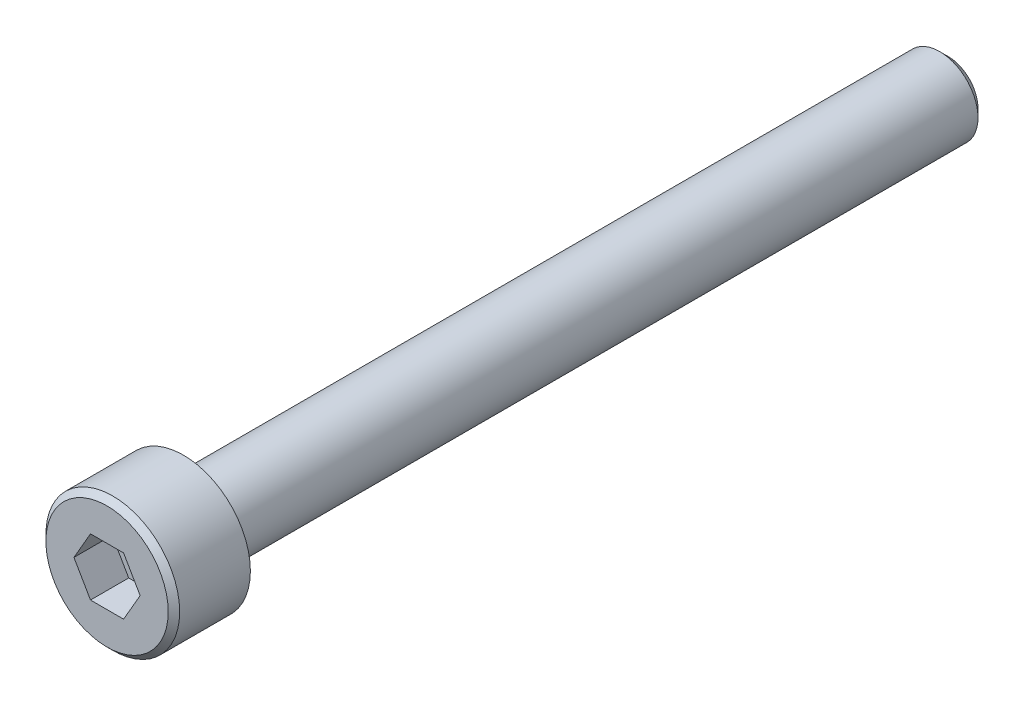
ISO-10303-21;
HEADER;
FILE_DESCRIPTION(('STEP AP214'),'2;1');
FILE_NAME('part.step','',(''),(''),'','','');
FILE_SCHEMA(('AUTOMOTIVE_DESIGN { 1 0 10303 214 1 1 1 1 }'));
ENDSEC;
DATA;
#1=APPLICATION_CONTEXT('core data for automotive mechanical design processes');
#2=APPLICATION_PROTOCOL_DEFINITION('international standard','automotive_design',2000,#1);
#3=PRODUCT_CONTEXT('',#1,'mechanical');
#4=PRODUCT('Part','Part','',(#3));
#5=PRODUCT_RELATED_PRODUCT_CATEGORY('part','',(#4));
#6=PRODUCT_DEFINITION_FORMATION('','',#4);
#7=PRODUCT_DEFINITION_CONTEXT('part definition',#1,'design');
#8=PRODUCT_DEFINITION('design','',#6,#7);
#9=PRODUCT_DEFINITION_SHAPE('','',#8);
#10=(LENGTH_UNIT() NAMED_UNIT(*) SI_UNIT(.MILLI.,.METRE.));
#11=(NAMED_UNIT(*) PLANE_ANGLE_UNIT() SI_UNIT($,.RADIAN.));
#12=(NAMED_UNIT(*) SI_UNIT($,.STERADIAN.) SOLID_ANGLE_UNIT());
#13=UNCERTAINTY_MEASURE_WITH_UNIT(LENGTH_MEASURE(1.E-05),#10,'distance_accuracy_value','');
#14=(GEOMETRIC_REPRESENTATION_CONTEXT(3) GLOBAL_UNCERTAINTY_ASSIGNED_CONTEXT((#13)) GLOBAL_UNIT_ASSIGNED_CONTEXT((#10,
#11,#12)) REPRESENTATION_CONTEXT('',''));
#15=CARTESIAN_POINT('',(0.,0.,0.));
#16=DIRECTION('',(0.,0.,1.));
#17=DIRECTION('',(1.,0.,0.));
#18=AXIS2_PLACEMENT_3D('',#15,#16,#17);
#19=CARTESIAN_POINT('',(0.,0.,4.));
#20=DIRECTION('',(0.,0.,-1.));
#21=DIRECTION('',(-1.,0.,0.));
#22=AXIS2_PLACEMENT_3D('',#19,#20,#21);
#23=PLANE('',#22);
#24=DIRECTION('',(1.,0.,0.));
#25=VECTOR('',#24,1.);
#26=CARTESIAN_POINT('',(-0.866025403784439,-1.5,4.));
#27=LINE('',#26,#25);
#28=CARTESIAN_POINT('',(-0.866025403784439,-1.5,4.));
#29=VERTEX_POINT('',#28);
#30=CARTESIAN_POINT('',(0.866025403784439,-1.5,4.));
#31=VERTEX_POINT('',#30);
#32=EDGE_CURVE('E104',#29,#31,#27,.T.);
#33=ORIENTED_EDGE('',*,*,#32,.F.);
#34=DIRECTION('',(0.5,-0.866025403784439,0.));
#35=VECTOR('',#34,1.);
#36=CARTESIAN_POINT('',(-1.73205080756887,0.,4.));
#37=LINE('',#36,#35);
#38=CARTESIAN_POINT('',(-1.73205080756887,0.,4.));
#39=VERTEX_POINT('',#38);
#40=EDGE_CURVE('E30',#39,#29,#37,.T.);
#41=ORIENTED_EDGE('',*,*,#40,.F.);
#42=DIRECTION('',(-0.5,-0.866025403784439,0.));
#43=VECTOR('',#42,1.);
#44=CARTESIAN_POINT('',(-0.866025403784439,1.5,4.));
#45=LINE('',#44,#43);
#46=CARTESIAN_POINT('',(-0.866025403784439,1.5,4.));
#47=VERTEX_POINT('',#46);
#48=EDGE_CURVE('E113',#47,#39,#45,.T.);
#49=ORIENTED_EDGE('',*,*,#48,.F.);
#50=DIRECTION('',(-1.,0.,0.));
#51=VECTOR('',#50,1.);
#52=CARTESIAN_POINT('',(0.866025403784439,1.5,4.));
#53=LINE('',#52,#51);
#54=CARTESIAN_POINT('',(0.866025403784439,1.5,4.));
#55=VERTEX_POINT('',#54);
#56=EDGE_CURVE('E111',#55,#47,#53,.T.);
#57=ORIENTED_EDGE('',*,*,#56,.F.);
#58=DIRECTION('',(-0.5,0.866025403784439,0.));
#59=VECTOR('',#58,1.);
#60=CARTESIAN_POINT('',(1.73205080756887,0.,4.));
#61=LINE('',#60,#59);
#62=CARTESIAN_POINT('',(1.73205080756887,0.,4.));
#63=VERTEX_POINT('',#62);
#64=EDGE_CURVE('E78',#63,#55,#61,.T.);
#65=ORIENTED_EDGE('',*,*,#64,.F.);
#66=DIRECTION('',(0.5,0.866025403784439,0.));
#67=VECTOR('',#66,1.);
#68=CARTESIAN_POINT('',(0.866025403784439,-1.5,4.));
#69=LINE('',#68,#67);
#70=EDGE_CURVE('E107',#31,#63,#69,.T.);
#71=ORIENTED_EDGE('',*,*,#70,.F.);
#72=EDGE_LOOP('',(#33,#41,#49,#57,#65,#71));
#73=FACE_BOUND('',#72,.T.);
#74=CARTESIAN_POINT('',(0.,0.,4.));
#75=DIRECTION('',(0.,0.,1.));
#76=DIRECTION('',(1.,0.,0.));
#77=AXIS2_PLACEMENT_3D('',#74,#75,#76);
#78=CIRCLE('',#77,3.2);
#79=CARTESIAN_POINT('',(3.2,0.,4.));
#80=VERTEX_POINT('',#79);
#81=EDGE_CURVE('E11',#80,#80,#78,.T.);
#82=ORIENTED_EDGE('',*,*,#81,.T.);
#83=EDGE_LOOP('',(#82));
#84=FACE_BOUND('',#83,.T.);
#85=ADVANCED_FACE('F16',(#73,#84),#23,.F.);
#86=CARTESIAN_POINT('',(0.,0.,3.7));
#87=DIRECTION('',(0.,0.,-1.));
#88=DIRECTION('',(-1.,0.,0.));
#89=AXIS2_PLACEMENT_3D('',#86,#87,#88);
#90=CONICAL_SURFACE('',#89,3.5,0.785398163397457);
#91=ORIENTED_EDGE('',*,*,#81,.F.);
#92=EDGE_LOOP('',(#91));
#93=FACE_BOUND('',#92,.T.);
#94=CARTESIAN_POINT('',(0.,0.,3.7));
#95=DIRECTION('',(0.,0.,1.));
#96=DIRECTION('',(1.,0.,0.));
#97=AXIS2_PLACEMENT_3D('',#94,#95,#96);
#98=CIRCLE('',#97,3.5);
#99=CARTESIAN_POINT('',(3.5,0.,3.7));
#100=VERTEX_POINT('',#99);
#101=EDGE_CURVE('E23',#100,#100,#98,.T.);
#102=ORIENTED_EDGE('',*,*,#101,.T.);
#103=EDGE_LOOP('',(#102));
#104=FACE_BOUND('',#103,.T.);
#105=ADVANCED_FACE('F136',(#93,#104),#90,.T.);
#106=CARTESIAN_POINT('',(0.,0.,-40.));
#107=DIRECTION('',(0.,0.,1.));
#108=DIRECTION('',(1.,0.,0.));
#109=AXIS2_PLACEMENT_3D('',#106,#107,#108);
#110=CYLINDRICAL_SURFACE('',#109,3.5);
#111=ORIENTED_EDGE('',*,*,#101,.F.);
#112=EDGE_LOOP('',(#111));
#113=FACE_BOUND('',#112,.T.);
#114=CARTESIAN_POINT('',(0.,0.,0.));
#115=DIRECTION('',(0.,0.,1.));
#116=DIRECTION('',(1.,0.,0.));
#117=AXIS2_PLACEMENT_3D('',#114,#115,#116);
#118=CIRCLE('',#117,3.5);
#119=CARTESIAN_POINT('',(3.5,0.,0.));
#120=VERTEX_POINT('',#119);
#121=EDGE_CURVE('E131',#120,#120,#118,.T.);
#122=ORIENTED_EDGE('',*,*,#121,.T.);
#123=EDGE_LOOP('',(#122));
#124=FACE_BOUND('',#123,.T.);
#125=ADVANCED_FACE('F138',(#113,#124),#110,.T.);
#126=CARTESIAN_POINT('',(0.,3.5,0.));
#127=DIRECTION('',(0.,0.,1.));
#128=DIRECTION('',(1.,0.,0.));
#129=AXIS2_PLACEMENT_3D('',#126,#127,#128);
#130=PLANE('',#129);
#131=ORIENTED_EDGE('',*,*,#121,.F.);
#132=EDGE_LOOP('',(#131));
#133=FACE_BOUND('',#132,.T.);
#134=CARTESIAN_POINT('',(0.,0.,0.));
#135=DIRECTION('',(0.,0.,1.));
#136=DIRECTION('',(1.,0.,0.));
#137=AXIS2_PLACEMENT_3D('',#134,#135,#136);
#138=CIRCLE('',#137,2.);
#139=CARTESIAN_POINT('',(2.,0.,0.));
#140=VERTEX_POINT('',#139);
#141=EDGE_CURVE('E128',#140,#140,#138,.T.);
#142=ORIENTED_EDGE('',*,*,#141,.T.);
#143=EDGE_LOOP('',(#142));
#144=FACE_BOUND('',#143,.T.);
#145=ADVANCED_FACE('F141',(#133,#144),#130,.F.);
#146=CARTESIAN_POINT('',(0.,0.,-40.));
#147=DIRECTION('',(0.,0.,1.));
#148=DIRECTION('',(1.,0.,0.));
#149=AXIS2_PLACEMENT_3D('',#146,#147,#148);
#150=CYLINDRICAL_SURFACE('',#149,2.);
#151=ORIENTED_EDGE('',*,*,#141,.F.);
#152=EDGE_LOOP('',(#151));
#153=FACE_BOUND('',#152,.T.);
#154=CARTESIAN_POINT('',(0.,0.,-39.5705));
#155=DIRECTION('',(0.,0.,1.));
#156=DIRECTION('',(1.,0.,0.));
#157=AXIS2_PLACEMENT_3D('',#154,#155,#156);
#158=CIRCLE('',#157,2.);
#159=CARTESIAN_POINT('',(2.,0.,-39.5705));
#160=VERTEX_POINT('',#159);
#161=EDGE_CURVE('E125',#160,#160,#158,.T.);
#162=ORIENTED_EDGE('',*,*,#161,.T.);
#163=EDGE_LOOP('',(#162));
#164=FACE_BOUND('',#163,.T.);
#165=ADVANCED_FACE('F147',(#153,#164),#150,.T.);
#166=CARTESIAN_POINT('',(0.,0.,-40.));
#167=DIRECTION('',(0.,0.,1.));
#168=DIRECTION('',(1.,0.,0.));
#169=AXIS2_PLACEMENT_3D('',#166,#167,#168);
#170=CONICAL_SURFACE('',#169,1.5705,0.785398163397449);
#171=ORIENTED_EDGE('',*,*,#161,.F.);
#172=EDGE_LOOP('',(#171));
#173=FACE_BOUND('',#172,.T.);
#174=CARTESIAN_POINT('',(0.,0.,-40.));
#175=DIRECTION('',(0.,0.,1.));
#176=DIRECTION('',(1.,0.,0.));
#177=AXIS2_PLACEMENT_3D('',#174,#175,#176);
#178=CIRCLE('',#177,1.5705);
#179=CARTESIAN_POINT('',(1.5705,0.,-40.));
#180=VERTEX_POINT('',#179);
#181=EDGE_CURVE('E117',#180,#180,#178,.T.);
#182=ORIENTED_EDGE('',*,*,#181,.T.);
#183=EDGE_LOOP('',(#182));
#184=FACE_BOUND('',#183,.T.);
#185=ADVANCED_FACE('F153',(#173,#184),#170,.T.);
#186=CARTESIAN_POINT('',(0.,1.5705,-40.));
#187=DIRECTION('',(0.,0.,1.));
#188=DIRECTION('',(1.,0.,0.));
#189=AXIS2_PLACEMENT_3D('',#186,#187,#188);
#190=PLANE('',#189);
#191=ORIENTED_EDGE('',*,*,#181,.F.);
#192=EDGE_LOOP('',(#191));
#193=FACE_BOUND('',#192,.T.);
#194=ADVANCED_FACE('F159',(#193),#190,.F.);
#195=CARTESIAN_POINT('',(-1.73205080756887,0.,2.));
#196=DIRECTION('',(-0.866025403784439,-0.5,0.));
#197=DIRECTION('',(0.5,-0.866025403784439,0.));
#198=AXIS2_PLACEMENT_3D('',#195,#196,#197);
#199=PLANE('',#198);
#200=ORIENTED_EDGE('',*,*,#40,.T.);
#201=DIRECTION('',(0.,0.,1.));
#202=VECTOR('',#201,1.);
#203=CARTESIAN_POINT('',(-0.866025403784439,-1.5,2.));
#204=LINE('',#203,#202);
#205=CARTESIAN_POINT('',(-0.866025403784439,-1.5,2.));
#206=VERTEX_POINT('',#205);
#207=EDGE_CURVE('E60',#206,#29,#204,.T.);
#208=ORIENTED_EDGE('',*,*,#207,.F.);
#209=DIRECTION('',(0.5,-0.866025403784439,0.));
#210=VECTOR('',#209,1.);
#211=CARTESIAN_POINT('',(-1.73205080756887,0.,2.));
#212=LINE('',#211,#210);
#213=CARTESIAN_POINT('',(-1.73205080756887,0.,2.));
#214=VERTEX_POINT('',#213);
#215=EDGE_CURVE('E115',#214,#206,#212,.T.);
#216=ORIENTED_EDGE('',*,*,#215,.F.);
#217=DIRECTION('',(0.,0.,1.));
#218=VECTOR('',#217,1.);
#219=CARTESIAN_POINT('',(-1.73205080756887,0.,2.));
#220=LINE('',#219,#218);
#221=EDGE_CURVE('E38',#214,#39,#220,.T.);
#222=ORIENTED_EDGE('',*,*,#221,.T.);
#223=EDGE_LOOP('',(#200,#208,#216,#222));
#224=FACE_BOUND('',#223,.T.);
#225=ADVANCED_FACE('F164',(#224),#199,.F.);
#226=CARTESIAN_POINT('',(-0.866025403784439,1.5,2.));
#227=DIRECTION('',(-0.866025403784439,0.5,0.));
#228=DIRECTION('',(-0.5,-0.866025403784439,0.));
#229=AXIS2_PLACEMENT_3D('',#226,#227,#228);
#230=PLANE('',#229);
#231=ORIENTED_EDGE('',*,*,#48,.T.);
#232=ORIENTED_EDGE('',*,*,#221,.F.);
#233=DIRECTION('',(-0.5,-0.866025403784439,0.));
#234=VECTOR('',#233,1.);
#235=CARTESIAN_POINT('',(-0.866025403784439,1.5,2.));
#236=LINE('',#235,#234);
#237=CARTESIAN_POINT('',(-0.866025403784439,1.5,2.));
#238=VERTEX_POINT('',#237);
#239=EDGE_CURVE('E90',#238,#214,#236,.T.);
#240=ORIENTED_EDGE('',*,*,#239,.F.);
#241=DIRECTION('',(0.,0.,1.));
#242=VECTOR('',#241,1.);
#243=CARTESIAN_POINT('',(-0.866025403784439,1.5,2.));
#244=LINE('',#243,#242);
#245=EDGE_CURVE('E82',#238,#47,#244,.T.);
#246=ORIENTED_EDGE('',*,*,#245,.T.);
#247=EDGE_LOOP('',(#231,#232,#240,#246));
#248=FACE_BOUND('',#247,.T.);
#249=ADVANCED_FACE('F171',(#248),#230,.F.);
#250=CARTESIAN_POINT('',(0.866025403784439,1.5,2.));
#251=DIRECTION('',(0.,1.,0.));
#252=DIRECTION('',(0.,0.,1.));
#253=AXIS2_PLACEMENT_3D('',#250,#251,#252);
#254=PLANE('',#253);
#255=ORIENTED_EDGE('',*,*,#56,.T.);
#256=ORIENTED_EDGE('',*,*,#245,.F.);
#257=DIRECTION('',(-1.,0.,0.));
#258=VECTOR('',#257,1.);
#259=CARTESIAN_POINT('',(0.866025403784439,1.5,2.));
#260=LINE('',#259,#258);
#261=CARTESIAN_POINT('',(0.866025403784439,1.5,2.));
#262=VERTEX_POINT('',#261);
#263=EDGE_CURVE('E86',#262,#238,#260,.T.);
#264=ORIENTED_EDGE('',*,*,#263,.F.);
#265=DIRECTION('',(0.,0.,1.));
#266=VECTOR('',#265,1.);
#267=CARTESIAN_POINT('',(0.866025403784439,1.5,2.));
#268=LINE('',#267,#266);
#269=EDGE_CURVE('E71',#262,#55,#268,.T.);
#270=ORIENTED_EDGE('',*,*,#269,.T.);
#271=EDGE_LOOP('',(#255,#256,#264,#270));
#272=FACE_BOUND('',#271,.T.);
#273=ADVANCED_FACE('F87',(#272),#254,.F.);
#274=CARTESIAN_POINT('',(1.73205080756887,0.,2.));
#275=DIRECTION('',(0.866025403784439,0.5,0.));
#276=DIRECTION('',(-0.5,0.866025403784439,0.));
#277=AXIS2_PLACEMENT_3D('',#274,#275,#276);
#278=PLANE('',#277);
#279=ORIENTED_EDGE('',*,*,#64,.T.);
#280=ORIENTED_EDGE('',*,*,#269,.F.);
#281=DIRECTION('',(-0.5,0.866025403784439,0.));
#282=VECTOR('',#281,1.);
#283=CARTESIAN_POINT('',(1.73205080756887,0.,2.));
#284=LINE('',#283,#282);
#285=CARTESIAN_POINT('',(1.73205080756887,0.,2.));
#286=VERTEX_POINT('',#285);
#287=EDGE_CURVE('E75',#286,#262,#284,.T.);
#288=ORIENTED_EDGE('',*,*,#287,.F.);
#289=DIRECTION('',(0.,0.,1.));
#290=VECTOR('',#289,1.);
#291=CARTESIAN_POINT('',(1.73205080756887,0.,2.));
#292=LINE('',#291,#290);
#293=EDGE_CURVE('E83',#286,#63,#292,.T.);
#294=ORIENTED_EDGE('',*,*,#293,.T.);
#295=EDGE_LOOP('',(#279,#280,#288,#294));
#296=FACE_BOUND('',#295,.T.);
#297=ADVANCED_FACE('F73',(#296),#278,.F.);
#298=CARTESIAN_POINT('',(0.866025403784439,-1.5,2.));
#299=DIRECTION('',(0.866025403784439,-0.5,0.));
#300=DIRECTION('',(0.5,0.866025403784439,0.));
#301=AXIS2_PLACEMENT_3D('',#298,#299,#300);
#302=PLANE('',#301);
#303=ORIENTED_EDGE('',*,*,#70,.T.);
#304=ORIENTED_EDGE('',*,*,#293,.F.);
#305=DIRECTION('',(0.5,0.866025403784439,0.));
#306=VECTOR('',#305,1.);
#307=CARTESIAN_POINT('',(0.866025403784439,-1.5,2.));
#308=LINE('',#307,#306);
#309=CARTESIAN_POINT('',(0.866025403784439,-1.5,2.));
#310=VERTEX_POINT('',#309);
#311=EDGE_CURVE('E96',#310,#286,#308,.T.);
#312=ORIENTED_EDGE('',*,*,#311,.F.);
#313=DIRECTION('',(0.,0.,1.));
#314=VECTOR('',#313,1.);
#315=CARTESIAN_POINT('',(0.866025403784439,-1.5,2.));
#316=LINE('',#315,#314);
#317=EDGE_CURVE('E120',#310,#31,#316,.T.);
#318=ORIENTED_EDGE('',*,*,#317,.T.);
#319=EDGE_LOOP('',(#303,#304,#312,#318));
#320=FACE_BOUND('',#319,.T.);
#321=ADVANCED_FACE('F199',(#320),#302,.F.);
#322=CARTESIAN_POINT('',(-0.866025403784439,-1.5,2.));
#323=DIRECTION('',(0.,-1.,0.));
#324=DIRECTION('',(0.,0.,-1.));
#325=AXIS2_PLACEMENT_3D('',#322,#323,#324);
#326=PLANE('',#325);
#327=ORIENTED_EDGE('',*,*,#32,.T.);
#328=ORIENTED_EDGE('',*,*,#317,.F.);
#329=DIRECTION('',(1.,0.,0.));
#330=VECTOR('',#329,1.);
#331=CARTESIAN_POINT('',(-0.866025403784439,-1.5,2.));
#332=LINE('',#331,#330);
#333=EDGE_CURVE('E98',#206,#310,#332,.T.);
#334=ORIENTED_EDGE('',*,*,#333,.F.);
#335=ORIENTED_EDGE('',*,*,#207,.T.);
#336=EDGE_LOOP('',(#327,#328,#334,#335));
#337=FACE_BOUND('',#336,.T.);
#338=ADVANCED_FACE('F186',(#337),#326,.F.);
#339=CARTESIAN_POINT('',(0.,0.,2.));
#340=DIRECTION('',(0.,0.,1.));
#341=DIRECTION('',(1.,0.,0.));
#342=AXIS2_PLACEMENT_3D('',#339,#340,#341);
#343=PLANE('',#342);
#344=ORIENTED_EDGE('',*,*,#215,.T.);
#345=ORIENTED_EDGE('',*,*,#333,.T.);
#346=ORIENTED_EDGE('',*,*,#311,.T.);
#347=ORIENTED_EDGE('',*,*,#287,.T.);
#348=ORIENTED_EDGE('',*,*,#263,.T.);
#349=ORIENTED_EDGE('',*,*,#239,.T.);
#350=EDGE_LOOP('',(#344,#345,#346,#347,#348,#349));
#351=FACE_BOUND('',#350,.T.);
#352=ADVANCED_FACE('F93',(#351),#343,.T.);
#353=CLOSED_SHELL('',(#85,#105,#125,#145,#165,#185,#194,#225,#249,#273,#297,#321,#338,#352));
#354=MANIFOLD_SOLID_BREP('B1',#353);
#355=ADVANCED_BREP_SHAPE_REPRESENTATION('',(#18,#354),#14);
#356=SHAPE_DEFINITION_REPRESENTATION(#9,#355);
ENDSEC;
END-ISO-10303-21;
